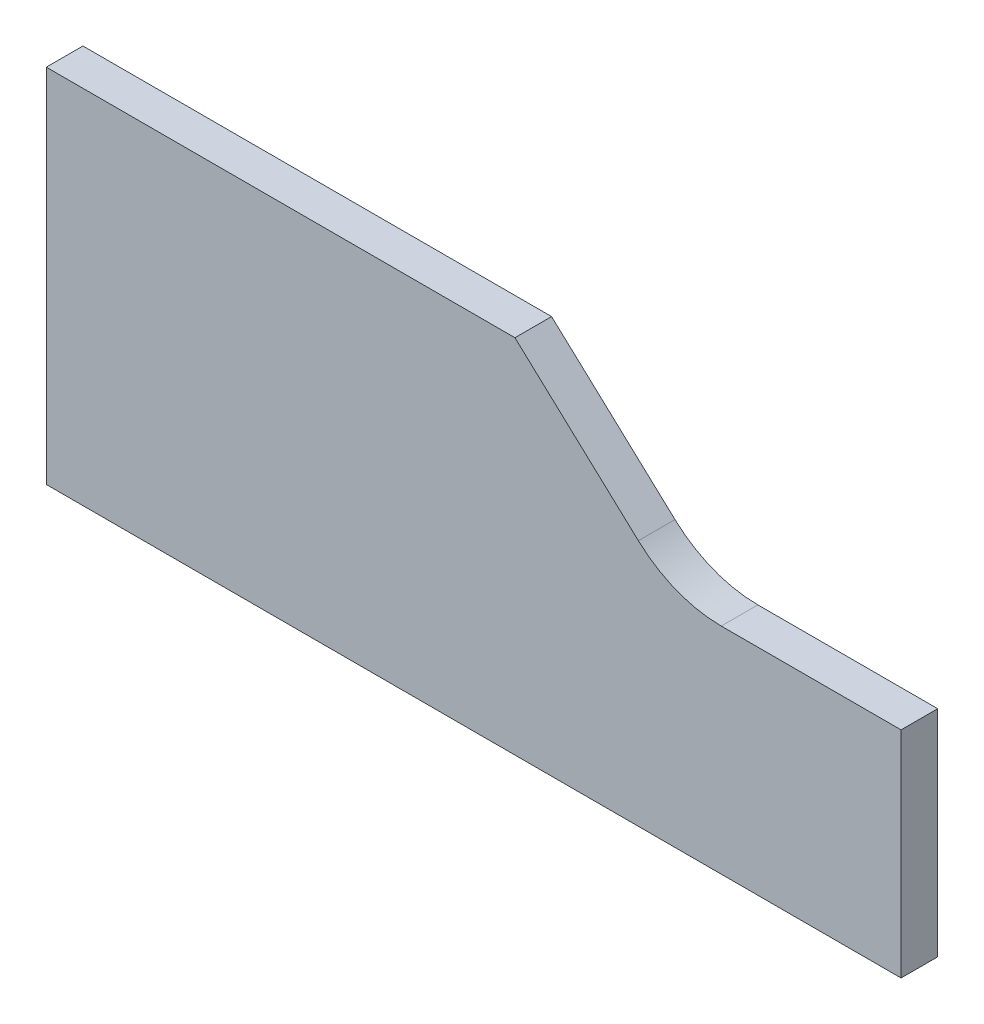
from build123d import *

# Parameters (mm, degrees)
AUFSATZ_LINEAR_AUSTRAGEN1_DEPTH = 1.5
VERRUNDUNG1_R                   = 10


with BuildPart() as part:
    # Skizze1 → Aufsatz-Linear austragen1 (new, symmetric)
    with BuildSketch(Plane.XY):
        Polygon((0, 0), (0, 29.59888487), (38.379483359, 29.59888487), (51.361450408, 17.59888487), (70, 17.59888487), (70, 0), align=None)
    extrude(amount=AUFSATZ_LINEAR_AUSTRAGEN1_DEPTH, both=True)

    # Verrundung1
    verrundung1_edges = [part.edges().sort_by_distance(p)[0] for p in [
        (51.361450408, 17.59888487, 0),
    ]]
    fillet(verrundung1_edges, radius=VERRUNDUNG1_R)


solid = part.part
